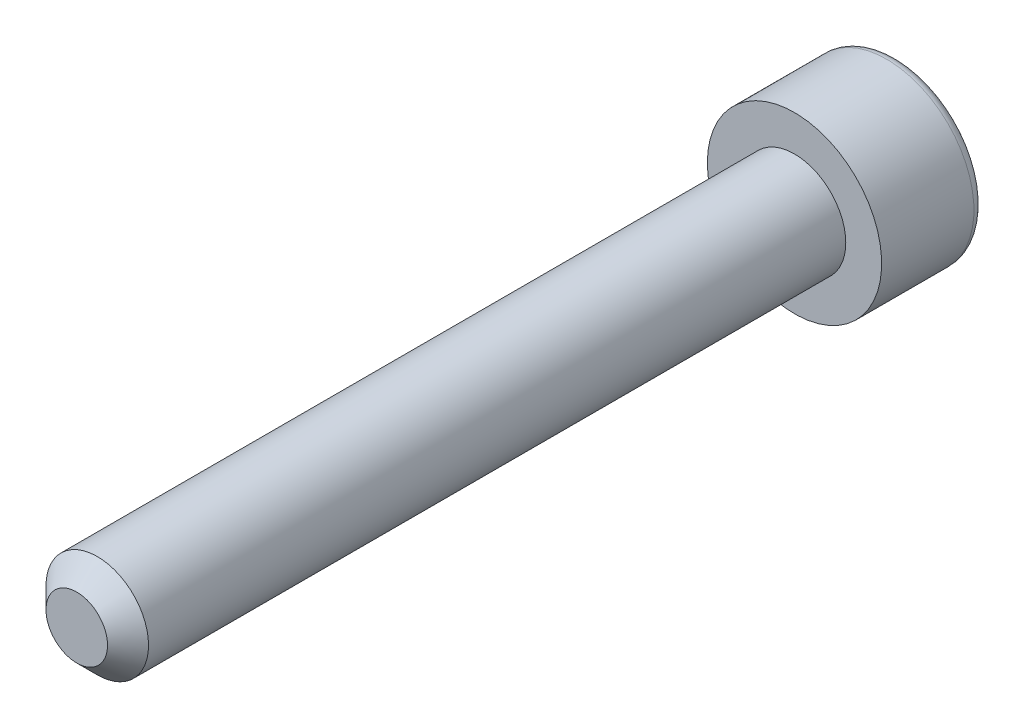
ISO-10303-21;
HEADER;
FILE_DESCRIPTION(('STEP AP214'),'2;1');
FILE_NAME('part.step','',(''),(''),'','','');
FILE_SCHEMA(('AUTOMOTIVE_DESIGN { 1 0 10303 214 1 1 1 1 }'));
ENDSEC;
DATA;
#1=APPLICATION_CONTEXT('core data for automotive mechanical design processes');
#2=APPLICATION_PROTOCOL_DEFINITION('international standard','automotive_design',2000,#1);
#3=PRODUCT_CONTEXT('',#1,'mechanical');
#4=PRODUCT('Part','Part','',(#3));
#5=PRODUCT_RELATED_PRODUCT_CATEGORY('part','',(#4));
#6=PRODUCT_DEFINITION_FORMATION('','',#4);
#7=PRODUCT_DEFINITION_CONTEXT('part definition',#1,'design');
#8=PRODUCT_DEFINITION('design','',#6,#7);
#9=PRODUCT_DEFINITION_SHAPE('','',#8);
#10=(LENGTH_UNIT() NAMED_UNIT(*) SI_UNIT(.MILLI.,.METRE.));
#11=(NAMED_UNIT(*) PLANE_ANGLE_UNIT() SI_UNIT($,.RADIAN.));
#12=(NAMED_UNIT(*) SI_UNIT($,.STERADIAN.) SOLID_ANGLE_UNIT());
#13=UNCERTAINTY_MEASURE_WITH_UNIT(LENGTH_MEASURE(1.E-05),#10,'distance_accuracy_value','');
#14=(GEOMETRIC_REPRESENTATION_CONTEXT(3) GLOBAL_UNCERTAINTY_ASSIGNED_CONTEXT((#13)) GLOBAL_UNIT_ASSIGNED_CONTEXT((#10,
#11,#12)) REPRESENTATION_CONTEXT('',''));
#15=CARTESIAN_POINT('',(0.,0.,0.));
#16=DIRECTION('',(0.,0.,1.));
#17=DIRECTION('',(1.,0.,0.));
#18=AXIS2_PLACEMENT_3D('',#15,#16,#17);
#19=CARTESIAN_POINT('',(0.,0.,-5.));
#20=DIRECTION('',(0.,0.,1.));
#21=DIRECTION('',(1.,0.,0.));
#22=AXIS2_PLACEMENT_3D('',#19,#20,#21);
#23=PLANE('',#22);
#24=CARTESIAN_POINT('',(0.,0.,-5.));
#25=DIRECTION('',(0.,0.,-1.));
#26=DIRECTION('',(-1.,0.,0.));
#27=AXIS2_PLACEMENT_3D('',#24,#25,#26);
#28=CIRCLE('',#27,3.75);
#29=CARTESIAN_POINT('',(-3.75,0.,-5.));
#30=VERTEX_POINT('',#29);
#31=EDGE_CURVE('E460',#30,#30,#28,.T.);
#32=ORIENTED_EDGE('',*,*,#31,.T.);
#33=EDGE_LOOP('',(#32));
#34=FACE_BOUND('',#33,.T.);
#35=DIRECTION('',(-0.86602540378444,0.499999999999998,0.));
#36=VECTOR('',#35,1.);
#37=CARTESIAN_POINT('',(0.,2.3094010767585,-5.));
#38=LINE('',#37,#36);
#39=CARTESIAN_POINT('',(2.,1.15470053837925,-5.));
#40=VERTEX_POINT('',#39);
#41=CARTESIAN_POINT('',(0.,2.3094010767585,-5.));
#42=VERTEX_POINT('',#41);
#43=EDGE_CURVE('E364',#40,#42,#38,.T.);
#44=ORIENTED_EDGE('',*,*,#43,.T.);
#45=DIRECTION('',(-0.866025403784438,-0.500000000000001,0.));
#46=VECTOR('',#45,1.);
#47=CARTESIAN_POINT('',(0.,2.3094010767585,-5.));
#48=LINE('',#47,#46);
#49=CARTESIAN_POINT('',(-2.,1.15470053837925,-5.));
#50=VERTEX_POINT('',#49);
#51=EDGE_CURVE('E404',#42,#50,#48,.T.);
#52=ORIENTED_EDGE('',*,*,#51,.T.);
#53=DIRECTION('',(0.,-1.,0.));
#54=VECTOR('',#53,1.);
#55=CARTESIAN_POINT('',(-2.,-1.15470053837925,-5.));
#56=LINE('',#55,#54);
#57=CARTESIAN_POINT('',(-2.,-1.15470053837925,-5.));
#58=VERTEX_POINT('',#57);
#59=EDGE_CURVE('E412',#50,#58,#56,.T.);
#60=ORIENTED_EDGE('',*,*,#59,.T.);
#61=DIRECTION('',(0.866025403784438,-0.500000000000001,0.));
#62=VECTOR('',#61,1.);
#63=CARTESIAN_POINT('',(0.,-2.3094010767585,-5.));
#64=LINE('',#63,#62);
#65=CARTESIAN_POINT('',(0.,-2.3094010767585,-5.));
#66=VERTEX_POINT('',#65);
#67=EDGE_CURVE('E430',#58,#66,#64,.T.);
#68=ORIENTED_EDGE('',*,*,#67,.T.);
#69=DIRECTION('',(0.86602540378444,0.499999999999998,0.));
#70=VECTOR('',#69,1.);
#71=CARTESIAN_POINT('',(0.,-2.3094010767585,-5.));
#72=LINE('',#71,#70);
#73=CARTESIAN_POINT('',(2.,-1.15470053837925,-5.));
#74=VERTEX_POINT('',#73);
#75=EDGE_CURVE('E433',#66,#74,#72,.T.);
#76=ORIENTED_EDGE('',*,*,#75,.T.);
#77=DIRECTION('',(0.,1.,0.));
#78=VECTOR('',#77,1.);
#79=CARTESIAN_POINT('',(2.,-1.15470053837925,-5.));
#80=LINE('',#79,#78);
#81=EDGE_CURVE('E423',#74,#40,#80,.T.);
#82=ORIENTED_EDGE('',*,*,#81,.T.);
#83=EDGE_LOOP('',(#44,#52,#60,#68,#76,#82));
#84=FACE_BOUND('',#83,.T.);
#85=ADVANCED_FACE('F350',(#34,#84),#23,.F.);
#86=CARTESIAN_POINT('',(0.,0.,-4.5));
#87=DIRECTION('',(0.,0.,-1.));
#88=DIRECTION('',(-1.,0.,0.));
#89=AXIS2_PLACEMENT_3D('',#86,#87,#88);
#90=TOROIDAL_SURFACE('',#89,3.75,0.5);
#91=ORIENTED_EDGE('',*,*,#31,.F.);
#92=EDGE_LOOP('',(#91));
#93=FACE_BOUND('',#92,.T.);
#94=CARTESIAN_POINT('',(0.,0.,-4.5));
#95=DIRECTION('',(0.,0.,-1.));
#96=DIRECTION('',(-1.,0.,0.));
#97=AXIS2_PLACEMENT_3D('',#94,#95,#96);
#98=CIRCLE('',#97,4.25);
#99=CARTESIAN_POINT('',(-4.25,0.,-4.5));
#100=VERTEX_POINT('',#99);
#101=EDGE_CURVE('E457',#100,#100,#98,.T.);
#102=ORIENTED_EDGE('',*,*,#101,.T.);
#103=EDGE_LOOP('',(#102));
#104=FACE_BOUND('',#103,.T.);
#105=ADVANCED_FACE('F479',(#93,#104),#90,.T.);
#106=CARTESIAN_POINT('',(0.,0.,0.));
#107=DIRECTION('',(0.,0.,-1.));
#108=DIRECTION('',(-1.,0.,0.));
#109=AXIS2_PLACEMENT_3D('',#106,#107,#108);
#110=CYLINDRICAL_SURFACE('',#109,4.25);
#111=ORIENTED_EDGE('',*,*,#101,.F.);
#112=EDGE_LOOP('',(#111));
#113=FACE_BOUND('',#112,.T.);
#114=CARTESIAN_POINT('',(0.,0.,0.));
#115=DIRECTION('',(0.,0.,-1.));
#116=DIRECTION('',(-1.,0.,0.));
#117=AXIS2_PLACEMENT_3D('',#114,#115,#116);
#118=CIRCLE('',#117,4.25);
#119=CARTESIAN_POINT('',(-4.25,0.,0.));
#120=VERTEX_POINT('',#119);
#121=EDGE_CURVE('E418',#120,#120,#118,.T.);
#122=ORIENTED_EDGE('',*,*,#121,.T.);
#123=EDGE_LOOP('',(#122));
#124=FACE_BOUND('',#123,.T.);
#125=ADVANCED_FACE('F484',(#113,#124),#110,.T.);
#126=CARTESIAN_POINT('',(0.,0.,0.));
#127=DIRECTION('',(0.,0.,-1.));
#128=DIRECTION('',(-1.,0.,0.));
#129=AXIS2_PLACEMENT_3D('',#126,#127,#128);
#130=PLANE('',#129);
#131=CARTESIAN_POINT('',(0.,0.,0.));
#132=DIRECTION('',(0.,0.,1.));
#133=DIRECTION('',(1.,0.,0.));
#134=AXIS2_PLACEMENT_3D('',#131,#132,#133);
#135=CIRCLE('',#134,2.5);
#136=CARTESIAN_POINT('',(2.5,0.,0.));
#137=VERTEX_POINT('',#136);
#138=EDGE_CURVE('E424',#137,#137,#135,.T.);
#139=ORIENTED_EDGE('',*,*,#138,.F.);
#140=EDGE_LOOP('',(#139));
#141=FACE_BOUND('',#140,.T.);
#142=ORIENTED_EDGE('',*,*,#121,.F.);
#143=EDGE_LOOP('',(#142));
#144=FACE_BOUND('',#143,.T.);
#145=ADVANCED_FACE('F492',(#141,#144),#130,.F.);
#146=CARTESIAN_POINT('',(0.,2.3094010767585,-2.5));
#147=DIRECTION('',(-0.499999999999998,-0.86602540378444,0.));
#148=DIRECTION('',(0.86602540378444,-0.499999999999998,0.));
#149=AXIS2_PLACEMENT_3D('',#146,#147,#148);
#150=PLANE('',#149);
#151=ORIENTED_EDGE('',*,*,#43,.F.);
#152=DIRECTION('',(0.,0.,-1.));
#153=VECTOR('',#152,1.);
#154=CARTESIAN_POINT('',(2.,1.15470053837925,-2.5));
#155=LINE('',#154,#153);
#156=CARTESIAN_POINT('',(2.,1.15470053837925,-2.5));
#157=VERTEX_POINT('',#156);
#158=EDGE_CURVE('E446',#157,#40,#155,.T.);
#159=ORIENTED_EDGE('',*,*,#158,.F.);
#160=DIRECTION('',(-0.86602540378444,0.499999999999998,0.));
#161=VECTOR('',#160,1.);
#162=CARTESIAN_POINT('',(0.,2.3094010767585,-2.5));
#163=LINE('',#162,#161);
#164=CARTESIAN_POINT('',(0.,2.3094010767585,-2.5));
#165=VERTEX_POINT('',#164);
#166=EDGE_CURVE('E417',#157,#165,#163,.T.);
#167=ORIENTED_EDGE('',*,*,#166,.T.);
#168=DIRECTION('',(0.,0.,-1.));
#169=VECTOR('',#168,1.);
#170=CARTESIAN_POINT('',(0.,2.3094010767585,-2.5));
#171=LINE('',#170,#169);
#172=EDGE_CURVE('E406',#165,#42,#171,.T.);
#173=ORIENTED_EDGE('',*,*,#172,.T.);
#174=EDGE_LOOP('',(#151,#159,#167,#173));
#175=FACE_BOUND('',#174,.T.);
#176=ADVANCED_FACE('F415',(#175),#150,.T.);
#177=CARTESIAN_POINT('',(0.,2.3094010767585,-2.5));
#178=DIRECTION('',(0.500000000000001,-0.866025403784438,0.));
#179=DIRECTION('',(0.866025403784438,0.500000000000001,0.));
#180=AXIS2_PLACEMENT_3D('',#177,#178,#179);
#181=PLANE('',#180);
#182=ORIENTED_EDGE('',*,*,#51,.F.);
#183=ORIENTED_EDGE('',*,*,#172,.F.);
#184=DIRECTION('',(-0.866025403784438,-0.500000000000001,0.));
#185=VECTOR('',#184,1.);
#186=CARTESIAN_POINT('',(0.,2.3094010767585,-2.5));
#187=LINE('',#186,#185);
#188=CARTESIAN_POINT('',(-2.,1.15470053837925,-2.5));
#189=VERTEX_POINT('',#188);
#190=EDGE_CURVE('E437',#165,#189,#187,.T.);
#191=ORIENTED_EDGE('',*,*,#190,.T.);
#192=DIRECTION('',(0.,0.,-1.));
#193=VECTOR('',#192,1.);
#194=CARTESIAN_POINT('',(-2.,1.15470053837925,-2.5));
#195=LINE('',#194,#193);
#196=EDGE_CURVE('E408',#189,#50,#195,.T.);
#197=ORIENTED_EDGE('',*,*,#196,.T.);
#198=EDGE_LOOP('',(#182,#183,#191,#197));
#199=FACE_BOUND('',#198,.T.);
#200=ADVANCED_FACE('F405',(#199),#181,.T.);
#201=CARTESIAN_POINT('',(-2.,-1.15470053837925,-2.5));
#202=DIRECTION('',(1.,0.,0.));
#203=DIRECTION('',(0.,0.,-1.));
#204=AXIS2_PLACEMENT_3D('',#201,#202,#203);
#205=PLANE('',#204);
#206=ORIENTED_EDGE('',*,*,#59,.F.);
#207=ORIENTED_EDGE('',*,*,#196,.F.);
#208=DIRECTION('',(0.,-1.,0.));
#209=VECTOR('',#208,1.);
#210=CARTESIAN_POINT('',(-2.,-1.15470053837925,-2.5));
#211=LINE('',#210,#209);
#212=CARTESIAN_POINT('',(-2.,-1.15470053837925,-2.5));
#213=VERTEX_POINT('',#212);
#214=EDGE_CURVE('E439',#189,#213,#211,.T.);
#215=ORIENTED_EDGE('',*,*,#214,.T.);
#216=DIRECTION('',(0.,0.,-1.));
#217=VECTOR('',#216,1.);
#218=CARTESIAN_POINT('',(-2.,-1.15470053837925,-2.5));
#219=LINE('',#218,#217);
#220=EDGE_CURVE('E452',#213,#58,#219,.T.);
#221=ORIENTED_EDGE('',*,*,#220,.T.);
#222=EDGE_LOOP('',(#206,#207,#215,#221));
#223=FACE_BOUND('',#222,.T.);
#224=ADVANCED_FACE('F507',(#223),#205,.T.);
#225=CARTESIAN_POINT('',(0.,-2.3094010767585,-2.5));
#226=DIRECTION('',(0.500000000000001,0.866025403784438,0.));
#227=DIRECTION('',(-0.866025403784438,0.500000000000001,0.));
#228=AXIS2_PLACEMENT_3D('',#225,#226,#227);
#229=PLANE('',#228);
#230=ORIENTED_EDGE('',*,*,#67,.F.);
#231=ORIENTED_EDGE('',*,*,#220,.F.);
#232=DIRECTION('',(0.866025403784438,-0.500000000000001,0.));
#233=VECTOR('',#232,1.);
#234=CARTESIAN_POINT('',(0.,-2.3094010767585,-2.5));
#235=LINE('',#234,#233);
#236=CARTESIAN_POINT('',(0.,-2.3094010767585,-2.5));
#237=VERTEX_POINT('',#236);
#238=EDGE_CURVE('E441',#213,#237,#235,.T.);
#239=ORIENTED_EDGE('',*,*,#238,.T.);
#240=DIRECTION('',(0.,0.,-1.));
#241=VECTOR('',#240,1.);
#242=CARTESIAN_POINT('',(0.,-2.3094010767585,-2.5));
#243=LINE('',#242,#241);
#244=EDGE_CURVE('E450',#237,#66,#243,.T.);
#245=ORIENTED_EDGE('',*,*,#244,.T.);
#246=EDGE_LOOP('',(#230,#231,#239,#245));
#247=FACE_BOUND('',#246,.T.);
#248=ADVANCED_FACE('F510',(#247),#229,.T.);
#249=CARTESIAN_POINT('',(0.,-2.3094010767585,-2.5));
#250=DIRECTION('',(-0.499999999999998,0.86602540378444,0.));
#251=DIRECTION('',(-0.86602540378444,-0.499999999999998,0.));
#252=AXIS2_PLACEMENT_3D('',#249,#250,#251);
#253=PLANE('',#252);
#254=ORIENTED_EDGE('',*,*,#75,.F.);
#255=ORIENTED_EDGE('',*,*,#244,.F.);
#256=DIRECTION('',(0.86602540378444,0.499999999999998,0.));
#257=VECTOR('',#256,1.);
#258=CARTESIAN_POINT('',(0.,-2.3094010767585,-2.5));
#259=LINE('',#258,#257);
#260=CARTESIAN_POINT('',(2.,-1.15470053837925,-2.5));
#261=VERTEX_POINT('',#260);
#262=EDGE_CURVE('E443',#237,#261,#259,.T.);
#263=ORIENTED_EDGE('',*,*,#262,.T.);
#264=DIRECTION('',(0.,0.,-1.));
#265=VECTOR('',#264,1.);
#266=CARTESIAN_POINT('',(2.,-1.15470053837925,-2.5));
#267=LINE('',#266,#265);
#268=EDGE_CURVE('E448',#261,#74,#267,.T.);
#269=ORIENTED_EDGE('',*,*,#268,.T.);
#270=EDGE_LOOP('',(#254,#255,#263,#269));
#271=FACE_BOUND('',#270,.T.);
#272=ADVANCED_FACE('F514',(#271),#253,.T.);
#273=CARTESIAN_POINT('',(2.,-1.15470053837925,-2.5));
#274=DIRECTION('',(-1.,0.,0.));
#275=DIRECTION('',(0.,0.,1.));
#276=AXIS2_PLACEMENT_3D('',#273,#274,#275);
#277=PLANE('',#276);
#278=ORIENTED_EDGE('',*,*,#81,.F.);
#279=ORIENTED_EDGE('',*,*,#268,.F.);
#280=DIRECTION('',(0.,1.,0.));
#281=VECTOR('',#280,1.);
#282=CARTESIAN_POINT('',(2.,-1.15470053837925,-2.5));
#283=LINE('',#282,#281);
#284=EDGE_CURVE('E371',#261,#157,#283,.T.);
#285=ORIENTED_EDGE('',*,*,#284,.T.);
#286=ORIENTED_EDGE('',*,*,#158,.T.);
#287=EDGE_LOOP('',(#278,#279,#285,#286));
#288=FACE_BOUND('',#287,.T.);
#289=ADVANCED_FACE('F518',(#288),#277,.T.);
#290=CARTESIAN_POINT('',(2.,1.15470053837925,-2.5));
#291=DIRECTION('',(0.,0.,1.));
#292=DIRECTION('',(1.,0.,0.));
#293=AXIS2_PLACEMENT_3D('',#290,#291,#292);
#294=PLANE('',#293);
#295=ORIENTED_EDGE('',*,*,#166,.F.);
#296=ORIENTED_EDGE('',*,*,#284,.F.);
#297=ORIENTED_EDGE('',*,*,#262,.F.);
#298=ORIENTED_EDGE('',*,*,#238,.F.);
#299=ORIENTED_EDGE('',*,*,#214,.F.);
#300=ORIENTED_EDGE('',*,*,#190,.F.);
#301=EDGE_LOOP('',(#295,#296,#297,#298,#299,#300));
#302=FACE_BOUND('',#301,.T.);
#303=ADVANCED_FACE('F522',(#302),#294,.F.);
#304=CARTESIAN_POINT('',(0.,0.,35.));
#305=DIRECTION('',(0.,0.,1.));
#306=DIRECTION('',(1.,0.,0.));
#307=AXIS2_PLACEMENT_3D('',#304,#305,#306);
#308=PLANE('',#307);
#309=CARTESIAN_POINT('',(0.,0.,35.));
#310=DIRECTION('',(0.,0.,1.));
#311=DIRECTION('',(1.,0.,0.));
#312=AXIS2_PLACEMENT_3D('',#309,#310,#311);
#313=CIRCLE('',#312,1.49999999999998);
#314=CARTESIAN_POINT('',(1.49999999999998,0.,35.));
#315=VERTEX_POINT('',#314);
#316=EDGE_CURVE('E357',#315,#315,#313,.T.);
#317=ORIENTED_EDGE('',*,*,#316,.T.);
#318=EDGE_LOOP('',(#317));
#319=FACE_BOUND('',#318,.T.);
#320=ADVANCED_FACE('F465',(#319),#308,.T.);
#321=CARTESIAN_POINT('',(0.,0.,0.));
#322=DIRECTION('',(0.,0.,1.));
#323=DIRECTION('',(1.,0.,0.));
#324=AXIS2_PLACEMENT_3D('',#321,#322,#323);
#325=CYLINDRICAL_SURFACE('',#324,2.5);
#326=CARTESIAN_POINT('',(0.,0.,34.));
#327=DIRECTION('',(0.,0.,1.));
#328=DIRECTION('',(1.,0.,0.));
#329=AXIS2_PLACEMENT_3D('',#326,#327,#328);
#330=CIRCLE('',#329,2.5);
#331=CARTESIAN_POINT('',(2.5,0.,34.));
#332=VERTEX_POINT('',#331);
#333=EDGE_CURVE('E11',#332,#332,#330,.F.);
#334=ORIENTED_EDGE('',*,*,#333,.T.);
#335=EDGE_LOOP('',(#334));
#336=FACE_BOUND('',#335,.T.);
#337=ORIENTED_EDGE('',*,*,#138,.T.);
#338=EDGE_LOOP('',(#337));
#339=FACE_BOUND('',#338,.T.);
#340=ADVANCED_FACE('F469',(#336,#339),#325,.T.);
#341=CARTESIAN_POINT('',(0.,0.,35.));
#342=DIRECTION('',(0.,0.,-1.));
#343=DIRECTION('',(-1.,0.,0.));
#344=AXIS2_PLACEMENT_3D('',#341,#342,#343);
#345=CONICAL_SURFACE('',#344,1.49999999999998,0.785398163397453);
#346=ORIENTED_EDGE('',*,*,#333,.F.);
#347=EDGE_LOOP('',(#346));
#348=FACE_BOUND('',#347,.T.);
#349=ORIENTED_EDGE('',*,*,#316,.F.);
#350=EDGE_LOOP('',(#349));
#351=FACE_BOUND('',#350,.T.);
#352=ADVANCED_FACE('F467',(#348,#351),#345,.T.);
#353=CLOSED_SHELL('',(#85,#105,#125,#145,#176,#200,#224,#248,#272,#289,#303,#320,#340,#352));
#354=MANIFOLD_SOLID_BREP('B2',#353);
#355=ADVANCED_BREP_SHAPE_REPRESENTATION('',(#18,#354),#14);
#356=SHAPE_DEFINITION_REPRESENTATION(#9,#355);
ENDSEC;
END-ISO-10303-21;
